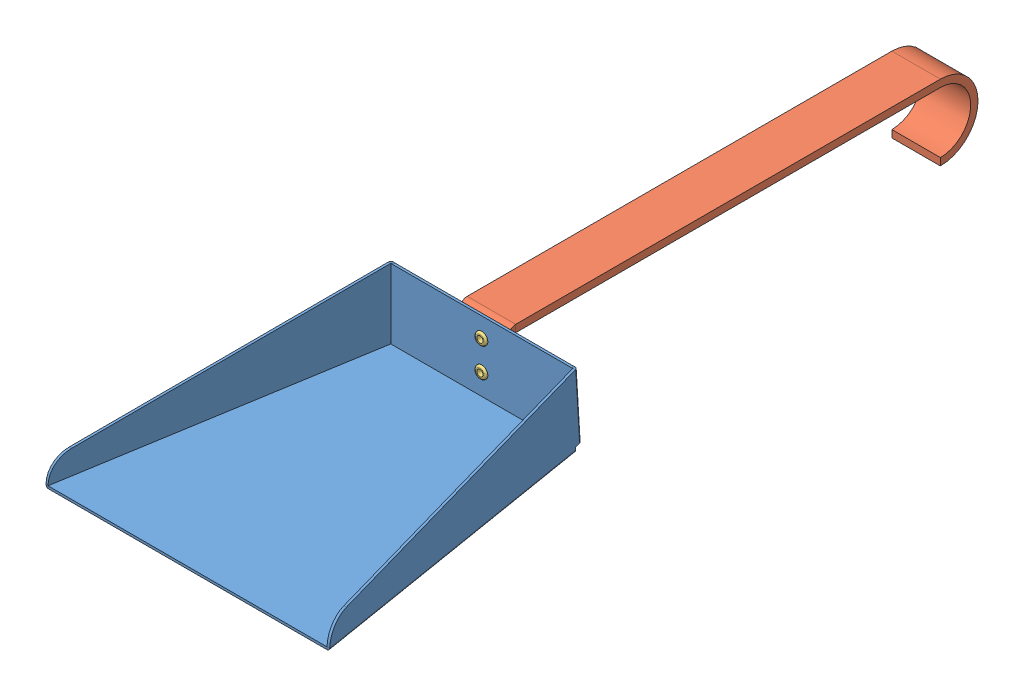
SolidWorks assembly AssembledShovel.SLDASM, configuration Default (file format 4100). Lengths in mm.
Overall size (116.97 31.07 315.74).
4 component instances, 3 part files, 7 mates.
Components (placement in the parent):
- Shovel-1: Shovel.SLDPRT [Default] at (-48.7606 -37.7013 51.344) size (116.97 29.83 124.33)
- Handle-1: Handle.SLDPRT [Default] at (18.7394 -10.9455 -48.9002) x (0 0 -1) z (1 0 0) size (193.5 31 20)
- dia3-4mmthickaluminium-1: dia3-4mmthickaluminium.SLDPRT [Default] at (8.7394 -15.9455 -69.9002) x (1 0 0) z (0 1 0) size (5 5.5 5)
- dia3-4mmthickaluminium-2: dia3-4mmthickaluminium.SLDPRT [Default] at (8.7394 -27.9455 -69.9002) x (1 0 0) z (0 1 0) size (5 5.5 5)
Mates (geometry in assembly coordinates):
- Coincident1: coincident anti-aligned: plane of Shovel-1 through (-47.1331 -148.0789 -70.9002) normal (0 0 -1); plane of Handle-1 through (-1.2606 -35.9455 -70.9002) normal (0 0 1)
- Concentric1: concentric aligned: cylinder of Shovel-1 through (8.7394 -15.9455 -69.9002) axis (0 0 -1) radius 1.75; cylinder of Handle-1 through (8.7394 -15.9455 -70.9002) axis (0 0 -1) radius 1.75
- Concentric2: concentric aligned: cylinder of Shovel-1 through (8.7394 -27.9455 -69.9002) axis (0 0 -1) radius 1.75; cylinder of Handle-1 through (8.7394 -27.9455 -70.9002) axis (0 0 -1) radius 1.75
- Concentric3: concentric anti-aligned: cylinder of Handle-1 through (8.7394 -15.9455 -70.9002) axis (0 0 -1) radius 1.75; cylinder of dia3-4mmthickaluminium-1 through (8.7394 -15.9455 -73.9002) axis (0 0 1) radius 1.5
- Concentric4: concentric anti-aligned: cylinder of Handle-1 through (8.7394 -27.9455 -70.9002) axis (0 0 -1) radius 1.75; cylinder of dia3-4mmthickaluminium-2 through (8.7394 -27.9455 -73.9002) axis (0 0 1) radius 1.5
- Coincident2: coincident anti-aligned: plane of Handle-1 through (-1.2606 -35.9455 -73.9002) normal (0 0 -1); plane of dia3-4mmthickaluminium-2 through (8.7394 -27.9455 -73.9002) normal (0 0 1)
- Coincident3: coincident anti-aligned: plane of Shovel-1 through (-47.1331 -148.0789 -69.9002) normal (0 0 1); plane of dia3-4mmthickaluminium-1 through (8.7394 -15.9455 -69.9002) normal (0 0 -1)
